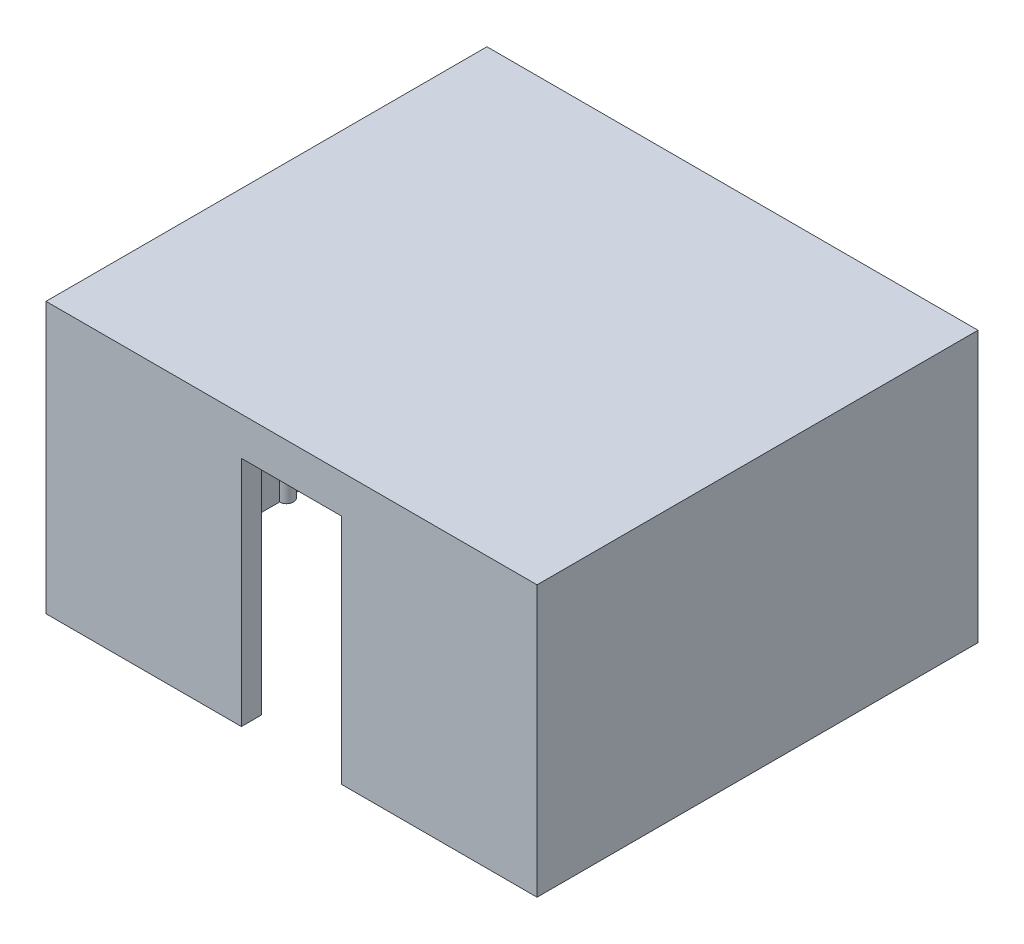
ISO-10303-21;
HEADER;
FILE_DESCRIPTION(('STEP AP214'),'2;1');
FILE_NAME('part.step','',(''),(''),'','','');
FILE_SCHEMA(('AUTOMOTIVE_DESIGN { 1 0 10303 214 1 1 1 1 }'));
ENDSEC;
DATA;
#1=APPLICATION_CONTEXT('core data for automotive mechanical design processes');
#2=APPLICATION_PROTOCOL_DEFINITION('international standard','automotive_design',2000,#1);
#3=PRODUCT_CONTEXT('',#1,'mechanical');
#4=PRODUCT('Part','Part','',(#3));
#5=PRODUCT_RELATED_PRODUCT_CATEGORY('part','',(#4));
#6=PRODUCT_DEFINITION_FORMATION('','',#4);
#7=PRODUCT_DEFINITION_CONTEXT('part definition',#1,'design');
#8=PRODUCT_DEFINITION('design','',#6,#7);
#9=PRODUCT_DEFINITION_SHAPE('','',#8);
#10=(LENGTH_UNIT() NAMED_UNIT(*) SI_UNIT(.MILLI.,.METRE.));
#11=(NAMED_UNIT(*) PLANE_ANGLE_UNIT() SI_UNIT($,.RADIAN.));
#12=(NAMED_UNIT(*) SI_UNIT($,.STERADIAN.) SOLID_ANGLE_UNIT());
#13=UNCERTAINTY_MEASURE_WITH_UNIT(LENGTH_MEASURE(1.E-05),#10,'distance_accuracy_value','');
#14=(GEOMETRIC_REPRESENTATION_CONTEXT(3) GLOBAL_UNCERTAINTY_ASSIGNED_CONTEXT((#13)) GLOBAL_UNIT_ASSIGNED_CONTEXT((#10,
#11,#12)) REPRESENTATION_CONTEXT('',''));
#15=CARTESIAN_POINT('',(0.,0.,0.));
#16=DIRECTION('',(0.,0.,1.));
#17=DIRECTION('',(1.,0.,0.));
#18=AXIS2_PLACEMENT_3D('',#15,#16,#17);
#19=CARTESIAN_POINT('',(-2.,27.,0.));
#20=DIRECTION('',(-1.,0.,0.));
#21=DIRECTION('',(0.,0.,1.));
#22=AXIS2_PLACEMENT_3D('',#19,#20,#21);
#23=PLANE('',#22);
#24=DIRECTION('',(0.,0.,-1.));
#25=VECTOR('',#24,1.);
#26=CARTESIAN_POINT('',(-2.,25.,0.));
#27=LINE('',#26,#25);
#28=CARTESIAN_POINT('',(-2.,25.,-2.));
#29=VERTEX_POINT('',#28);
#30=CARTESIAN_POINT('',(-2.,25.,-21.3));
#31=VERTEX_POINT('',#30);
#32=EDGE_CURVE('E196',#29,#31,#27,.T.);
#33=ORIENTED_EDGE('',*,*,#32,.T.);
#34=DIRECTION('',(0.,1.,0.));
#35=VECTOR('',#34,1.);
#36=CARTESIAN_POINT('',(-2.,0.,-21.3));
#37=LINE('',#36,#35);
#38=CARTESIAN_POINT('',(-2.,0.,-21.3));
#39=VERTEX_POINT('',#38);
#40=EDGE_CURVE('E62',#31,#39,#37,.F.);
#41=ORIENTED_EDGE('',*,*,#40,.T.);
#42=DIRECTION('',(0.,0.,-1.));
#43=VECTOR('',#42,1.);
#44=CARTESIAN_POINT('',(-2.,0.,0.));
#45=LINE('',#44,#43);
#46=CARTESIAN_POINT('',(-2.,0.,-2.));
#47=VERTEX_POINT('',#46);
#48=EDGE_CURVE('E288',#47,#39,#45,.T.);
#49=ORIENTED_EDGE('',*,*,#48,.F.);
#50=DIRECTION('',(0.,-1.,0.));
#51=VECTOR('',#50,1.);
#52=CARTESIAN_POINT('',(-2.,27.,-2.));
#53=LINE('',#52,#51);
#54=EDGE_CURVE('E270',#29,#47,#53,.T.);
#55=ORIENTED_EDGE('',*,*,#54,.F.);
#56=EDGE_LOOP('',(#33,#41,#49,#55));
#57=FACE_BOUND('',#56,.T.);
#58=ADVANCED_FACE('F39',(#57),#23,.T.);
#59=CARTESIAN_POINT('',(-2.,0.,-22.7));
#60=VERTEX_POINT('',#59);
#61=CARTESIAN_POINT('',(-2.,0.,-42.));
#62=VERTEX_POINT('',#61);
#63=EDGE_CURVE('E54',#60,#62,#45,.T.);
#64=ORIENTED_EDGE('',*,*,#63,.F.);
#65=DIRECTION('',(0.,1.,0.));
#66=VECTOR('',#65,1.);
#67=CARTESIAN_POINT('',(-2.,0.,-22.7));
#68=LINE('',#67,#66);
#69=CARTESIAN_POINT('',(-2.,25.,-22.7));
#70=VERTEX_POINT('',#69);
#71=EDGE_CURVE('E199',#60,#70,#68,.T.);
#72=ORIENTED_EDGE('',*,*,#71,.T.);
#73=CARTESIAN_POINT('',(-2.,25.,-42.));
#74=VERTEX_POINT('',#73);
#75=EDGE_CURVE('E190',#70,#74,#27,.T.);
#76=ORIENTED_EDGE('',*,*,#75,.T.);
#77=DIRECTION('',(0.,-1.,0.));
#78=VECTOR('',#77,1.);
#79=CARTESIAN_POINT('',(-2.,27.,-42.));
#80=LINE('',#79,#78);
#81=EDGE_CURVE('E265',#74,#62,#80,.T.);
#82=ORIENTED_EDGE('',*,*,#81,.T.);
#83=EDGE_LOOP('',(#64,#72,#76,#82));
#84=FACE_BOUND('',#83,.T.);
#85=ADVANCED_FACE('F200',(#84),#23,.T.);
#86=CARTESIAN_POINT('',(0.,27.,-2.));
#87=DIRECTION('',(0.,0.,-1.));
#88=DIRECTION('',(-1.,0.,0.));
#89=AXIS2_PLACEMENT_3D('',#86,#87,#88);
#90=PLANE('',#89);
#91=DIRECTION('',(1.,0.,0.));
#92=VECTOR('',#91,1.);
#93=CARTESIAN_POINT('',(0.,25.,-2.));
#94=LINE('',#93,#92);
#95=CARTESIAN_POINT('',(-47.,25.,-1.99999999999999));
#96=VERTEX_POINT('',#95);
#97=CARTESIAN_POINT('',(-38.95,25.,-2.));
#98=VERTEX_POINT('',#97);
#99=EDGE_CURVE('E274',#96,#98,#94,.T.);
#100=ORIENTED_EDGE('',*,*,#99,.T.);
#101=DIRECTION('',(0.,1.,0.));
#102=VECTOR('',#101,1.);
#103=CARTESIAN_POINT('',(-38.95,0.,-2.));
#104=LINE('',#103,#102);
#105=CARTESIAN_POINT('',(-38.95,0.,-2.));
#106=VERTEX_POINT('',#105);
#107=EDGE_CURVE('E216',#98,#106,#104,.F.);
#108=ORIENTED_EDGE('',*,*,#107,.T.);
#109=DIRECTION('',(1.,0.,0.));
#110=VECTOR('',#109,1.);
#111=CARTESIAN_POINT('',(0.,0.,-2.));
#112=LINE('',#111,#110);
#113=CARTESIAN_POINT('',(-47.,0.,-1.99999999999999));
#114=VERTEX_POINT('',#113);
#115=EDGE_CURVE('E197',#114,#106,#112,.T.);
#116=ORIENTED_EDGE('',*,*,#115,.F.);
#117=DIRECTION('',(0.,-1.,0.));
#118=VECTOR('',#117,1.);
#119=CARTESIAN_POINT('',(-47.,27.,-1.99999999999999));
#120=LINE('',#119,#118);
#121=EDGE_CURVE('E273',#96,#114,#120,.T.);
#122=ORIENTED_EDGE('',*,*,#121,.F.);
#123=EDGE_LOOP('',(#100,#108,#116,#122));
#124=FACE_BOUND('',#123,.T.);
#125=ADVANCED_FACE('F353',(#124),#90,.T.);
#126=CARTESIAN_POINT('',(-37.55,0.,-2.));
#127=VERTEX_POINT('',#126);
#128=CARTESIAN_POINT('',(-29.5,0.,-2.));
#129=VERTEX_POINT('',#128);
#130=EDGE_CURVE('E293',#127,#129,#112,.T.);
#131=ORIENTED_EDGE('',*,*,#130,.F.);
#132=DIRECTION('',(0.,1.,0.));
#133=VECTOR('',#132,1.);
#134=CARTESIAN_POINT('',(-37.55,0.,-2.));
#135=LINE('',#134,#133);
#136=CARTESIAN_POINT('',(-37.55,25.,-2.));
#137=VERTEX_POINT('',#136);
#138=EDGE_CURVE('E210',#127,#137,#135,.T.);
#139=ORIENTED_EDGE('',*,*,#138,.T.);
#140=CARTESIAN_POINT('',(-11.45,25.,-2.));
#141=VERTEX_POINT('',#140);
#142=EDGE_CURVE('E287',#137,#141,#94,.T.);
#143=ORIENTED_EDGE('',*,*,#142,.T.);
#144=DIRECTION('',(0.,1.,0.));
#145=VECTOR('',#144,1.);
#146=CARTESIAN_POINT('',(-11.45,0.,-2.));
#147=LINE('',#146,#145);
#148=CARTESIAN_POINT('',(-11.45,0.,-2.));
#149=VERTEX_POINT('',#148);
#150=EDGE_CURVE('E224',#141,#149,#147,.F.);
#151=ORIENTED_EDGE('',*,*,#150,.T.);
#152=CARTESIAN_POINT('',(-19.5,0.,-2.));
#153=VERTEX_POINT('',#152);
#154=EDGE_CURVE('E294',#153,#149,#112,.T.);
#155=ORIENTED_EDGE('',*,*,#154,.F.);
#156=DIRECTION('',(0.,-1.,0.));
#157=VECTOR('',#156,1.);
#158=CARTESIAN_POINT('',(-19.5,27.,-2.));
#159=LINE('',#158,#157);
#160=CARTESIAN_POINT('',(-19.5,23.1834678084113,-2.));
#161=VERTEX_POINT('',#160);
#162=EDGE_CURVE('E334',#161,#153,#159,.T.);
#163=ORIENTED_EDGE('',*,*,#162,.F.);
#164=DIRECTION('',(1.,0.,0.));
#165=VECTOR('',#164,1.);
#166=CARTESIAN_POINT('',(0.,23.1834678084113,-2.));
#167=LINE('',#166,#165);
#168=CARTESIAN_POINT('',(-29.5,23.1834678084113,-2.));
#169=VERTEX_POINT('',#168);
#170=EDGE_CURVE('E336',#169,#161,#167,.T.);
#171=ORIENTED_EDGE('',*,*,#170,.F.);
#172=DIRECTION('',(0.,1.,0.));
#173=VECTOR('',#172,1.);
#174=CARTESIAN_POINT('',(-29.5,27.,-2.));
#175=LINE('',#174,#173);
#176=EDGE_CURVE('E339',#129,#169,#175,.T.);
#177=ORIENTED_EDGE('',*,*,#176,.F.);
#178=EDGE_LOOP('',(#131,#139,#143,#151,#155,#163,#171,#177));
#179=FACE_BOUND('',#178,.T.);
#180=ADVANCED_FACE('F390',(#179),#90,.T.);
#181=CARTESIAN_POINT('',(-10.05,0.,-2.));
#182=VERTEX_POINT('',#181);
#183=EDGE_CURVE('E298',#182,#47,#112,.T.);
#184=ORIENTED_EDGE('',*,*,#183,.F.);
#185=DIRECTION('',(0.,1.,0.));
#186=VECTOR('',#185,1.);
#187=CARTESIAN_POINT('',(-10.05,0.,-2.));
#188=LINE('',#187,#186);
#189=CARTESIAN_POINT('',(-10.05,25.,-2.));
#190=VERTEX_POINT('',#189);
#191=EDGE_CURVE('E221',#182,#190,#188,.T.);
#192=ORIENTED_EDGE('',*,*,#191,.T.);
#193=EDGE_CURVE('E284',#190,#29,#94,.T.);
#194=ORIENTED_EDGE('',*,*,#193,.T.);
#195=ORIENTED_EDGE('',*,*,#54,.T.);
#196=EDGE_LOOP('',(#184,#192,#194,#195));
#197=FACE_BOUND('',#196,.T.);
#198=ADVANCED_FACE('F383',(#197),#90,.T.);
#199=CARTESIAN_POINT('',(0.,27.,-42.));
#200=DIRECTION('',(0.,0.,1.));
#201=DIRECTION('',(1.,0.,0.));
#202=AXIS2_PLACEMENT_3D('',#199,#200,#201);
#203=PLANE('',#202);
#204=DIRECTION('',(-1.,0.,0.));
#205=VECTOR('',#204,1.);
#206=CARTESIAN_POINT('',(0.,25.,-42.));
#207=LINE('',#206,#205);
#208=CARTESIAN_POINT('',(-23.8,25.,-42.));
#209=VERTEX_POINT('',#208);
#210=EDGE_CURVE('E194',#74,#209,#207,.T.);
#211=ORIENTED_EDGE('',*,*,#210,.T.);
#212=DIRECTION('',(0.,1.,0.));
#213=VECTOR('',#212,1.);
#214=CARTESIAN_POINT('',(-23.8,0.,-42.));
#215=LINE('',#214,#213);
#216=CARTESIAN_POINT('',(-23.8,0.,-42.));
#217=VERTEX_POINT('',#216);
#218=EDGE_CURVE('E235',#209,#217,#215,.F.);
#219=ORIENTED_EDGE('',*,*,#218,.T.);
#220=DIRECTION('',(-1.,0.,0.));
#221=VECTOR('',#220,1.);
#222=CARTESIAN_POINT('',(0.,0.,-42.));
#223=LINE('',#222,#221);
#224=EDGE_CURVE('E300',#62,#217,#223,.T.);
#225=ORIENTED_EDGE('',*,*,#224,.F.);
#226=ORIENTED_EDGE('',*,*,#81,.F.);
#227=EDGE_LOOP('',(#211,#219,#225,#226));
#228=FACE_BOUND('',#227,.T.);
#229=ADVANCED_FACE('F375',(#228),#203,.T.);
#230=CARTESIAN_POINT('',(-25.2,0.,-42.));
#231=VERTEX_POINT('',#230);
#232=CARTESIAN_POINT('',(-47.,0.,-42.));
#233=VERTEX_POINT('',#232);
#234=EDGE_CURVE('E290',#231,#233,#223,.T.);
#235=ORIENTED_EDGE('',*,*,#234,.F.);
#236=DIRECTION('',(0.,1.,0.));
#237=VECTOR('',#236,1.);
#238=CARTESIAN_POINT('',(-25.2,0.,-42.));
#239=LINE('',#238,#237);
#240=CARTESIAN_POINT('',(-25.2,25.,-42.));
#241=VERTEX_POINT('',#240);
#242=EDGE_CURVE('E230',#231,#241,#239,.T.);
#243=ORIENTED_EDGE('',*,*,#242,.T.);
#244=CARTESIAN_POINT('',(-47.,25.,-42.));
#245=VERTEX_POINT('',#244);
#246=EDGE_CURVE('E269',#241,#245,#207,.T.);
#247=ORIENTED_EDGE('',*,*,#246,.T.);
#248=DIRECTION('',(0.,-1.,0.));
#249=VECTOR('',#248,1.);
#250=CARTESIAN_POINT('',(-47.,27.,-42.));
#251=LINE('',#250,#249);
#252=EDGE_CURVE('E267',#245,#233,#251,.T.);
#253=ORIENTED_EDGE('',*,*,#252,.T.);
#254=EDGE_LOOP('',(#235,#243,#247,#253));
#255=FACE_BOUND('',#254,.T.);
#256=ADVANCED_FACE('F370',(#255),#203,.T.);
#257=CARTESIAN_POINT('',(-47.,27.,0.));
#258=DIRECTION('',(1.,0.,0.));
#259=DIRECTION('',(0.,0.,-1.));
#260=AXIS2_PLACEMENT_3D('',#257,#258,#259);
#261=PLANE('',#260);
#262=DIRECTION('',(0.,0.,1.));
#263=VECTOR('',#262,1.);
#264=CARTESIAN_POINT('',(-47.,25.,0.));
#265=LINE('',#264,#263);
#266=CARTESIAN_POINT('',(-47.,25.,-22.7));
#267=VERTEX_POINT('',#266);
#268=EDGE_CURVE('E281',#245,#267,#265,.T.);
#269=ORIENTED_EDGE('',*,*,#268,.T.);
#270=DIRECTION('',(0.,1.,0.));
#271=VECTOR('',#270,1.);
#272=CARTESIAN_POINT('',(-47.,0.,-22.7));
#273=LINE('',#272,#271);
#274=CARTESIAN_POINT('',(-47.,0.,-22.7));
#275=VERTEX_POINT('',#274);
#276=EDGE_CURVE('E246',#267,#275,#273,.F.);
#277=ORIENTED_EDGE('',*,*,#276,.T.);
#278=DIRECTION('',(0.,0.,1.));
#279=VECTOR('',#278,1.);
#280=CARTESIAN_POINT('',(-47.,0.,0.));
#281=LINE('',#280,#279);
#282=EDGE_CURVE('E295',#233,#275,#281,.T.);
#283=ORIENTED_EDGE('',*,*,#282,.F.);
#284=ORIENTED_EDGE('',*,*,#252,.F.);
#285=EDGE_LOOP('',(#269,#277,#283,#284));
#286=FACE_BOUND('',#285,.T.);
#287=ADVANCED_FACE('F363',(#286),#261,.T.);
#288=CARTESIAN_POINT('',(-47.,0.,-21.3));
#289=VERTEX_POINT('',#288);
#290=EDGE_CURVE('E299',#289,#114,#281,.T.);
#291=ORIENTED_EDGE('',*,*,#290,.F.);
#292=DIRECTION('',(0.,1.,0.));
#293=VECTOR('',#292,1.);
#294=CARTESIAN_POINT('',(-47.,0.,-21.3));
#295=LINE('',#294,#293);
#296=CARTESIAN_POINT('',(-47.,25.,-21.3));
#297=VERTEX_POINT('',#296);
#298=EDGE_CURVE('E241',#289,#297,#295,.T.);
#299=ORIENTED_EDGE('',*,*,#298,.T.);
#300=EDGE_CURVE('E278',#297,#96,#265,.T.);
#301=ORIENTED_EDGE('',*,*,#300,.T.);
#302=ORIENTED_EDGE('',*,*,#121,.T.);
#303=EDGE_LOOP('',(#291,#299,#301,#302));
#304=FACE_BOUND('',#303,.T.);
#305=ADVANCED_FACE('F356',(#304),#261,.T.);
#306=CARTESIAN_POINT('',(0.,27.,0.));
#307=DIRECTION('',(-1.,0.,0.));
#308=DIRECTION('',(0.,0.,1.));
#309=AXIS2_PLACEMENT_3D('',#306,#307,#308);
#310=PLANE('',#309);
#311=DIRECTION('',(0.,0.,-1.));
#312=VECTOR('',#311,1.);
#313=CARTESIAN_POINT('',(0.,0.,0.));
#314=LINE('',#313,#312);
#315=CARTESIAN_POINT('',(0.,0.,0.));
#316=VERTEX_POINT('',#315);
#317=CARTESIAN_POINT('',(0.,0.,-44.));
#318=VERTEX_POINT('',#317);
#319=EDGE_CURVE('E266',#316,#318,#314,.T.);
#320=ORIENTED_EDGE('',*,*,#319,.T.);
#321=DIRECTION('',(0.,-1.,0.));
#322=VECTOR('',#321,1.);
#323=CARTESIAN_POINT('',(0.,27.,-44.));
#324=LINE('',#323,#322);
#325=CARTESIAN_POINT('',(0.,27.,-44.));
#326=VERTEX_POINT('',#325);
#327=EDGE_CURVE('E331',#326,#318,#324,.T.);
#328=ORIENTED_EDGE('',*,*,#327,.F.);
#329=DIRECTION('',(0.,0.,-1.));
#330=VECTOR('',#329,1.);
#331=CARTESIAN_POINT('',(0.,27.,0.));
#332=LINE('',#331,#330);
#333=CARTESIAN_POINT('',(0.,27.,0.));
#334=VERTEX_POINT('',#333);
#335=EDGE_CURVE('E303',#334,#326,#332,.T.);
#336=ORIENTED_EDGE('',*,*,#335,.F.);
#337=DIRECTION('',(0.,-1.,0.));
#338=VECTOR('',#337,1.);
#339=CARTESIAN_POINT('',(0.,27.,0.));
#340=LINE('',#339,#338);
#341=EDGE_CURVE('E313',#334,#316,#340,.T.);
#342=ORIENTED_EDGE('',*,*,#341,.T.);
#343=EDGE_LOOP('',(#320,#328,#336,#342));
#344=FACE_BOUND('',#343,.T.);
#345=ADVANCED_FACE('F41',(#344),#310,.F.);
#346=CARTESIAN_POINT('',(0.,27.,-44.));
#347=DIRECTION('',(0.,0.,1.));
#348=DIRECTION('',(1.,0.,0.));
#349=AXIS2_PLACEMENT_3D('',#346,#347,#348);
#350=PLANE('',#349);
#351=DIRECTION('',(-1.,0.,0.));
#352=VECTOR('',#351,1.);
#353=CARTESIAN_POINT('',(0.,0.,-44.));
#354=LINE('',#353,#352);
#355=CARTESIAN_POINT('',(-49.,0.,-44.));
#356=VERTEX_POINT('',#355);
#357=EDGE_CURVE('E316',#318,#356,#354,.T.);
#358=ORIENTED_EDGE('',*,*,#357,.T.);
#359=DIRECTION('',(0.,-1.,0.));
#360=VECTOR('',#359,1.);
#361=CARTESIAN_POINT('',(-49.,27.,-44.));
#362=LINE('',#361,#360);
#363=CARTESIAN_POINT('',(-49.,27.,-44.));
#364=VERTEX_POINT('',#363);
#365=EDGE_CURVE('E328',#364,#356,#362,.T.);
#366=ORIENTED_EDGE('',*,*,#365,.F.);
#367=DIRECTION('',(-1.,0.,0.));
#368=VECTOR('',#367,1.);
#369=CARTESIAN_POINT('',(0.,27.,-44.));
#370=LINE('',#369,#368);
#371=EDGE_CURVE('E306',#326,#364,#370,.T.);
#372=ORIENTED_EDGE('',*,*,#371,.F.);
#373=ORIENTED_EDGE('',*,*,#327,.T.);
#374=EDGE_LOOP('',(#358,#366,#372,#373));
#375=FACE_BOUND('',#374,.T.);
#376=ADVANCED_FACE('F417',(#375),#350,.F.);
#377=CARTESIAN_POINT('',(-49.,27.,0.));
#378=DIRECTION('',(1.,0.,0.));
#379=DIRECTION('',(0.,0.,-1.));
#380=AXIS2_PLACEMENT_3D('',#377,#378,#379);
#381=PLANE('',#380);
#382=DIRECTION('',(0.,0.,1.));
#383=VECTOR('',#382,1.);
#384=CARTESIAN_POINT('',(-49.,0.,0.));
#385=LINE('',#384,#383);
#386=CARTESIAN_POINT('',(-49.,0.,0.));
#387=VERTEX_POINT('',#386);
#388=EDGE_CURVE('E318',#356,#387,#385,.T.);
#389=ORIENTED_EDGE('',*,*,#388,.T.);
#390=DIRECTION('',(0.,-1.,0.));
#391=VECTOR('',#390,1.);
#392=CARTESIAN_POINT('',(-49.,27.,0.));
#393=LINE('',#392,#391);
#394=CARTESIAN_POINT('',(-49.,27.,0.));
#395=VERTEX_POINT('',#394);
#396=EDGE_CURVE('E325',#395,#387,#393,.T.);
#397=ORIENTED_EDGE('',*,*,#396,.F.);
#398=DIRECTION('',(0.,0.,1.));
#399=VECTOR('',#398,1.);
#400=CARTESIAN_POINT('',(-49.,27.,0.));
#401=LINE('',#400,#399);
#402=EDGE_CURVE('E309',#364,#395,#401,.T.);
#403=ORIENTED_EDGE('',*,*,#402,.F.);
#404=ORIENTED_EDGE('',*,*,#365,.T.);
#405=EDGE_LOOP('',(#389,#397,#403,#404));
#406=FACE_BOUND('',#405,.T.);
#407=ADVANCED_FACE('F413',(#406),#381,.F.);
#408=CARTESIAN_POINT('',(0.,27.,0.));
#409=DIRECTION('',(0.,0.,-1.));
#410=DIRECTION('',(-1.,0.,0.));
#411=AXIS2_PLACEMENT_3D('',#408,#409,#410);
#412=PLANE('',#411);
#413=DIRECTION('',(1.,0.,0.));
#414=VECTOR('',#413,1.);
#415=CARTESIAN_POINT('',(0.,0.,0.));
#416=LINE('',#415,#414);
#417=CARTESIAN_POINT('',(-29.5,0.,0.));
#418=VERTEX_POINT('',#417);
#419=EDGE_CURVE('E307',#387,#418,#416,.T.);
#420=ORIENTED_EDGE('',*,*,#419,.T.);
#421=DIRECTION('',(0.,-1.,0.));
#422=VECTOR('',#421,1.);
#423=CARTESIAN_POINT('',(-29.5,0.,0.));
#424=LINE('',#423,#422);
#425=CARTESIAN_POINT('',(-29.5,23.1834678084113,0.));
#426=VERTEX_POINT('',#425);
#427=EDGE_CURVE('E248',#426,#418,#424,.T.);
#428=ORIENTED_EDGE('',*,*,#427,.F.);
#429=DIRECTION('',(-1.,0.,0.));
#430=VECTOR('',#429,1.);
#431=CARTESIAN_POINT('',(-29.5,23.1834678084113,0.));
#432=LINE('',#431,#430);
#433=CARTESIAN_POINT('',(-19.5,23.1834678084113,0.));
#434=VERTEX_POINT('',#433);
#435=EDGE_CURVE('E253',#434,#426,#432,.T.);
#436=ORIENTED_EDGE('',*,*,#435,.F.);
#437=DIRECTION('',(0.,1.,0.));
#438=VECTOR('',#437,1.);
#439=CARTESIAN_POINT('',(-19.5,0.,0.));
#440=LINE('',#439,#438);
#441=CARTESIAN_POINT('',(-19.5,0.,0.));
#442=VERTEX_POINT('',#441);
#443=EDGE_CURVE('E250',#442,#434,#440,.T.);
#444=ORIENTED_EDGE('',*,*,#443,.F.);
#445=EDGE_CURVE('E320',#442,#316,#416,.T.);
#446=ORIENTED_EDGE('',*,*,#445,.T.);
#447=ORIENTED_EDGE('',*,*,#341,.F.);
#448=DIRECTION('',(1.,0.,0.));
#449=VECTOR('',#448,1.);
#450=CARTESIAN_POINT('',(0.,27.,0.));
#451=LINE('',#450,#449);
#452=EDGE_CURVE('E311',#395,#334,#451,.T.);
#453=ORIENTED_EDGE('',*,*,#452,.F.);
#454=ORIENTED_EDGE('',*,*,#396,.T.);
#455=EDGE_LOOP('',(#420,#428,#436,#444,#446,#447,#453,#454));
#456=FACE_BOUND('',#455,.T.);
#457=ADVANCED_FACE('F407',(#456),#412,.F.);
#458=CARTESIAN_POINT('',(0.,27.,0.));
#459=DIRECTION('',(0.,1.,0.));
#460=DIRECTION('',(0.,0.,1.));
#461=AXIS2_PLACEMENT_3D('',#458,#459,#460);
#462=PLANE('',#461);
#463=ORIENTED_EDGE('',*,*,#335,.T.);
#464=ORIENTED_EDGE('',*,*,#371,.T.);
#465=ORIENTED_EDGE('',*,*,#402,.T.);
#466=ORIENTED_EDGE('',*,*,#452,.T.);
#467=EDGE_LOOP('',(#463,#464,#465,#466));
#468=FACE_BOUND('',#467,.T.);
#469=ADVANCED_FACE('F447',(#468),#462,.T.);
#470=CARTESIAN_POINT('',(0.,0.,0.));
#471=DIRECTION('',(0.,1.,0.));
#472=DIRECTION('',(0.,0.,1.));
#473=AXIS2_PLACEMENT_3D('',#470,#471,#472);
#474=PLANE('',#473);
#475=ORIENTED_EDGE('',*,*,#48,.T.);
#476=CARTESIAN_POINT('',(-2.,0.,-22.));
#477=DIRECTION('',(0.,-1.,0.));
#478=DIRECTION('',(0.,0.,-1.));
#479=AXIS2_PLACEMENT_3D('',#476,#477,#478);
#480=CIRCLE('',#479,0.699999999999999);
#481=EDGE_CURVE('E204',#39,#60,#480,.T.);
#482=ORIENTED_EDGE('',*,*,#481,.T.);
#483=ORIENTED_EDGE('',*,*,#63,.T.);
#484=ORIENTED_EDGE('',*,*,#224,.T.);
#485=CARTESIAN_POINT('',(-24.5,0.,-42.));
#486=DIRECTION('',(0.,-1.,0.));
#487=DIRECTION('',(0.,0.,-1.));
#488=AXIS2_PLACEMENT_3D('',#485,#486,#487);
#489=CIRCLE('',#488,0.699999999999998);
#490=EDGE_CURVE('E226',#217,#231,#489,.T.);
#491=ORIENTED_EDGE('',*,*,#490,.T.);
#492=ORIENTED_EDGE('',*,*,#234,.T.);
#493=ORIENTED_EDGE('',*,*,#282,.T.);
#494=CARTESIAN_POINT('',(-47.,0.,-22.));
#495=DIRECTION('',(0.,-1.,0.));
#496=DIRECTION('',(0.,0.,-1.));
#497=AXIS2_PLACEMENT_3D('',#494,#495,#496);
#498=CIRCLE('',#497,0.700000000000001);
#499=EDGE_CURVE('E238',#275,#289,#498,.T.);
#500=ORIENTED_EDGE('',*,*,#499,.T.);
#501=ORIENTED_EDGE('',*,*,#290,.T.);
#502=ORIENTED_EDGE('',*,*,#115,.T.);
#503=CARTESIAN_POINT('',(-38.25,0.,-2.));
#504=DIRECTION('',(0.,-1.,0.));
#505=DIRECTION('',(0.,0.,-1.));
#506=AXIS2_PLACEMENT_3D('',#503,#504,#505);
#507=CIRCLE('',#506,0.700000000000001);
#508=EDGE_CURVE('E207',#106,#127,#507,.T.);
#509=ORIENTED_EDGE('',*,*,#508,.T.);
#510=ORIENTED_EDGE('',*,*,#130,.T.);
#511=DIRECTION('',(0.,0.,1.));
#512=VECTOR('',#511,1.);
#513=CARTESIAN_POINT('',(-29.5,0.,-10.));
#514=LINE('',#513,#512);
#515=EDGE_CURVE('E256',#129,#418,#514,.T.);
#516=ORIENTED_EDGE('',*,*,#515,.T.);
#517=ORIENTED_EDGE('',*,*,#419,.F.);
#518=ORIENTED_EDGE('',*,*,#388,.F.);
#519=ORIENTED_EDGE('',*,*,#357,.F.);
#520=ORIENTED_EDGE('',*,*,#319,.F.);
#521=ORIENTED_EDGE('',*,*,#445,.F.);
#522=DIRECTION('',(0.,0.,1.));
#523=VECTOR('',#522,1.);
#524=CARTESIAN_POINT('',(-19.5,0.,-10.));
#525=LINE('',#524,#523);
#526=EDGE_CURVE('E261',#153,#442,#525,.T.);
#527=ORIENTED_EDGE('',*,*,#526,.F.);
#528=ORIENTED_EDGE('',*,*,#154,.T.);
#529=CARTESIAN_POINT('',(-10.75,0.,-2.));
#530=DIRECTION('',(0.,-1.,0.));
#531=DIRECTION('',(0.,0.,-1.));
#532=AXIS2_PLACEMENT_3D('',#529,#530,#531);
#533=CIRCLE('',#532,0.699999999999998);
#534=EDGE_CURVE('E218',#149,#182,#533,.T.);
#535=ORIENTED_EDGE('',*,*,#534,.T.);
#536=ORIENTED_EDGE('',*,*,#183,.T.);
#537=EDGE_LOOP('',(#475,#482,#483,#484,#491,#492,#493,#500,#501,#502,#509,#510,#516,#517,#518,
#519,#520,#521,#527,#528,#535,#536));
#538=FACE_BOUND('',#537,.T.);
#539=ADVANCED_FACE('F368',(#538),#474,.F.);
#540=CARTESIAN_POINT('',(0.,25.,0.));
#541=DIRECTION('',(0.,1.,0.));
#542=DIRECTION('',(0.,0.,1.));
#543=AXIS2_PLACEMENT_3D('',#540,#541,#542);
#544=PLANE('',#543);
#545=CARTESIAN_POINT('',(-2.,25.,-22.));
#546=DIRECTION('',(0.,1.,0.));
#547=DIRECTION('',(0.,0.,1.));
#548=AXIS2_PLACEMENT_3D('',#545,#546,#547);
#549=CIRCLE('',#548,0.699999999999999);
#550=EDGE_CURVE('E11',#31,#70,#549,.F.);
#551=ORIENTED_EDGE('',*,*,#550,.F.);
#552=ORIENTED_EDGE('',*,*,#32,.F.);
#553=ORIENTED_EDGE('',*,*,#193,.F.);
#554=CARTESIAN_POINT('',(-10.75,25.,-2.));
#555=DIRECTION('',(0.,1.,0.));
#556=DIRECTION('',(0.,0.,1.));
#557=AXIS2_PLACEMENT_3D('',#554,#555,#556);
#558=CIRCLE('',#557,0.699999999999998);
#559=EDGE_CURVE('E341',#141,#190,#558,.F.);
#560=ORIENTED_EDGE('',*,*,#559,.F.);
#561=ORIENTED_EDGE('',*,*,#142,.F.);
#562=CARTESIAN_POINT('',(-38.25,25.,-2.));
#563=DIRECTION('',(0.,1.,0.));
#564=DIRECTION('',(0.,0.,1.));
#565=AXIS2_PLACEMENT_3D('',#562,#563,#564);
#566=CIRCLE('',#565,0.700000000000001);
#567=EDGE_CURVE('E47',#98,#137,#566,.F.);
#568=ORIENTED_EDGE('',*,*,#567,.F.);
#569=ORIENTED_EDGE('',*,*,#99,.F.);
#570=ORIENTED_EDGE('',*,*,#300,.F.);
#571=CARTESIAN_POINT('',(-47.,25.,-22.));
#572=DIRECTION('',(0.,-1.,0.));
#573=DIRECTION('',(0.,0.,-1.));
#574=AXIS2_PLACEMENT_3D('',#571,#572,#573);
#575=CIRCLE('',#574,0.700000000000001);
#576=EDGE_CURVE('E237',#267,#297,#575,.T.);
#577=ORIENTED_EDGE('',*,*,#576,.F.);
#578=ORIENTED_EDGE('',*,*,#268,.F.);
#579=ORIENTED_EDGE('',*,*,#246,.F.);
#580=CARTESIAN_POINT('',(-24.5,25.,-42.));
#581=DIRECTION('',(0.,-1.,0.));
#582=DIRECTION('',(0.,0.,-1.));
#583=AXIS2_PLACEMENT_3D('',#580,#581,#582);
#584=CIRCLE('',#583,0.699999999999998);
#585=EDGE_CURVE('E227',#209,#241,#584,.T.);
#586=ORIENTED_EDGE('',*,*,#585,.F.);
#587=ORIENTED_EDGE('',*,*,#210,.F.);
#588=ORIENTED_EDGE('',*,*,#75,.F.);
#589=EDGE_LOOP('',(#551,#552,#553,#560,#561,#568,#569,#570,#577,#578,#579,#586,#587,#588));
#590=FACE_BOUND('',#589,.T.);
#591=ADVANCED_FACE('F191',(#590),#544,.F.);
#592=CARTESIAN_POINT('',(-29.5,0.,-10.));
#593=DIRECTION('',(-1.,0.,0.));
#594=DIRECTION('',(0.,0.,1.));
#595=AXIS2_PLACEMENT_3D('',#592,#593,#594);
#596=PLANE('',#595);
#597=ORIENTED_EDGE('',*,*,#176,.T.);
#598=DIRECTION('',(0.,0.,1.));
#599=VECTOR('',#598,1.);
#600=CARTESIAN_POINT('',(-29.5,23.1834678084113,-10.));
#601=LINE('',#600,#599);
#602=EDGE_CURVE('E257',#169,#426,#601,.T.);
#603=ORIENTED_EDGE('',*,*,#602,.T.);
#604=ORIENTED_EDGE('',*,*,#427,.T.);
#605=ORIENTED_EDGE('',*,*,#515,.F.);
#606=EDGE_LOOP('',(#597,#603,#604,#605));
#607=FACE_BOUND('',#606,.T.);
#608=ADVANCED_FACE('F398',(#607),#596,.F.);
#609=CARTESIAN_POINT('',(-29.5,23.1834678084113,-10.));
#610=DIRECTION('',(0.,1.,0.));
#611=DIRECTION('',(0.,0.,1.));
#612=AXIS2_PLACEMENT_3D('',#609,#610,#611);
#613=PLANE('',#612);
#614=ORIENTED_EDGE('',*,*,#170,.T.);
#615=DIRECTION('',(0.,0.,1.));
#616=VECTOR('',#615,1.);
#617=CARTESIAN_POINT('',(-19.5,23.1834678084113,-10.));
#618=LINE('',#617,#616);
#619=EDGE_CURVE('E259',#161,#434,#618,.T.);
#620=ORIENTED_EDGE('',*,*,#619,.T.);
#621=ORIENTED_EDGE('',*,*,#435,.T.);
#622=ORIENTED_EDGE('',*,*,#602,.F.);
#623=EDGE_LOOP('',(#614,#620,#621,#622));
#624=FACE_BOUND('',#623,.T.);
#625=ADVANCED_FACE('F403',(#624),#613,.F.);
#626=CARTESIAN_POINT('',(-19.5,0.,-10.));
#627=DIRECTION('',(1.,0.,0.));
#628=DIRECTION('',(0.,0.,-1.));
#629=AXIS2_PLACEMENT_3D('',#626,#627,#628);
#630=PLANE('',#629);
#631=ORIENTED_EDGE('',*,*,#162,.T.);
#632=ORIENTED_EDGE('',*,*,#526,.T.);
#633=ORIENTED_EDGE('',*,*,#443,.T.);
#634=ORIENTED_EDGE('',*,*,#619,.F.);
#635=EDGE_LOOP('',(#631,#632,#633,#634));
#636=FACE_BOUND('',#635,.T.);
#637=ADVANCED_FACE('F423',(#636),#630,.F.);
#638=CARTESIAN_POINT('',(-47.,0.,-22.));
#639=DIRECTION('',(0.,1.,0.));
#640=DIRECTION('',(0.,0.,1.));
#641=AXIS2_PLACEMENT_3D('',#638,#639,#640);
#642=CYLINDRICAL_SURFACE('',#641,0.700000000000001);
#643=ORIENTED_EDGE('',*,*,#276,.F.);
#644=ORIENTED_EDGE('',*,*,#576,.T.);
#645=ORIENTED_EDGE('',*,*,#298,.F.);
#646=ORIENTED_EDGE('',*,*,#499,.F.);
#647=EDGE_LOOP('',(#643,#644,#645,#646));
#648=FACE_BOUND('',#647,.T.);
#649=ADVANCED_FACE('F366',(#648),#642,.T.);
#650=CARTESIAN_POINT('',(-24.5,0.,-42.));
#651=DIRECTION('',(0.,1.,0.));
#652=DIRECTION('',(0.,0.,1.));
#653=AXIS2_PLACEMENT_3D('',#650,#651,#652);
#654=CYLINDRICAL_SURFACE('',#653,0.699999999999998);
#655=ORIENTED_EDGE('',*,*,#218,.F.);
#656=ORIENTED_EDGE('',*,*,#585,.T.);
#657=ORIENTED_EDGE('',*,*,#242,.F.);
#658=ORIENTED_EDGE('',*,*,#490,.F.);
#659=EDGE_LOOP('',(#655,#656,#657,#658));
#660=FACE_BOUND('',#659,.T.);
#661=ADVANCED_FACE('F378',(#660),#654,.T.);
#662=CARTESIAN_POINT('',(-10.75,0.,-2.));
#663=DIRECTION('',(0.,1.,0.));
#664=DIRECTION('',(0.,0.,1.));
#665=AXIS2_PLACEMENT_3D('',#662,#663,#664);
#666=CYLINDRICAL_SURFACE('',#665,0.699999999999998);
#667=ORIENTED_EDGE('',*,*,#150,.F.);
#668=ORIENTED_EDGE('',*,*,#559,.T.);
#669=ORIENTED_EDGE('',*,*,#191,.F.);
#670=ORIENTED_EDGE('',*,*,#534,.F.);
#671=EDGE_LOOP('',(#667,#668,#669,#670));
#672=FACE_BOUND('',#671,.T.);
#673=ADVANCED_FACE('F386',(#672),#666,.T.);
#674=CARTESIAN_POINT('',(-38.25,0.,-2.));
#675=DIRECTION('',(0.,1.,0.));
#676=DIRECTION('',(0.,0.,1.));
#677=AXIS2_PLACEMENT_3D('',#674,#675,#676);
#678=CYLINDRICAL_SURFACE('',#677,0.700000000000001);
#679=ORIENTED_EDGE('',*,*,#107,.F.);
#680=ORIENTED_EDGE('',*,*,#567,.T.);
#681=ORIENTED_EDGE('',*,*,#138,.F.);
#682=ORIENTED_EDGE('',*,*,#508,.F.);
#683=EDGE_LOOP('',(#679,#680,#681,#682));
#684=FACE_BOUND('',#683,.T.);
#685=ADVANCED_FACE('F347',(#684),#678,.T.);
#686=CARTESIAN_POINT('',(-2.,0.,-22.));
#687=DIRECTION('',(0.,1.,0.));
#688=DIRECTION('',(0.,0.,1.));
#689=AXIS2_PLACEMENT_3D('',#686,#687,#688);
#690=CYLINDRICAL_SURFACE('',#689,0.699999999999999);
#691=ORIENTED_EDGE('',*,*,#40,.F.);
#692=ORIENTED_EDGE('',*,*,#550,.T.);
#693=ORIENTED_EDGE('',*,*,#71,.F.);
#694=ORIENTED_EDGE('',*,*,#481,.F.);
#695=EDGE_LOOP('',(#691,#692,#693,#694));
#696=FACE_BOUND('',#695,.T.);
#697=ADVANCED_FACE('F206',(#696),#690,.T.);
#698=CLOSED_SHELL('',(#58,#85,#125,#180,#198,#229,#256,#287,#305,#345,#376,#407,#457,#469,#539,
#591,#608,#625,#637,#649,#661,#673,#685,#697));
#699=MANIFOLD_SOLID_BREP('B2',#698);
#700=ADVANCED_BREP_SHAPE_REPRESENTATION('',(#18,#699),#14);
#701=SHAPE_DEFINITION_REPRESENTATION(#9,#700);
ENDSEC;
END-ISO-10303-21;
